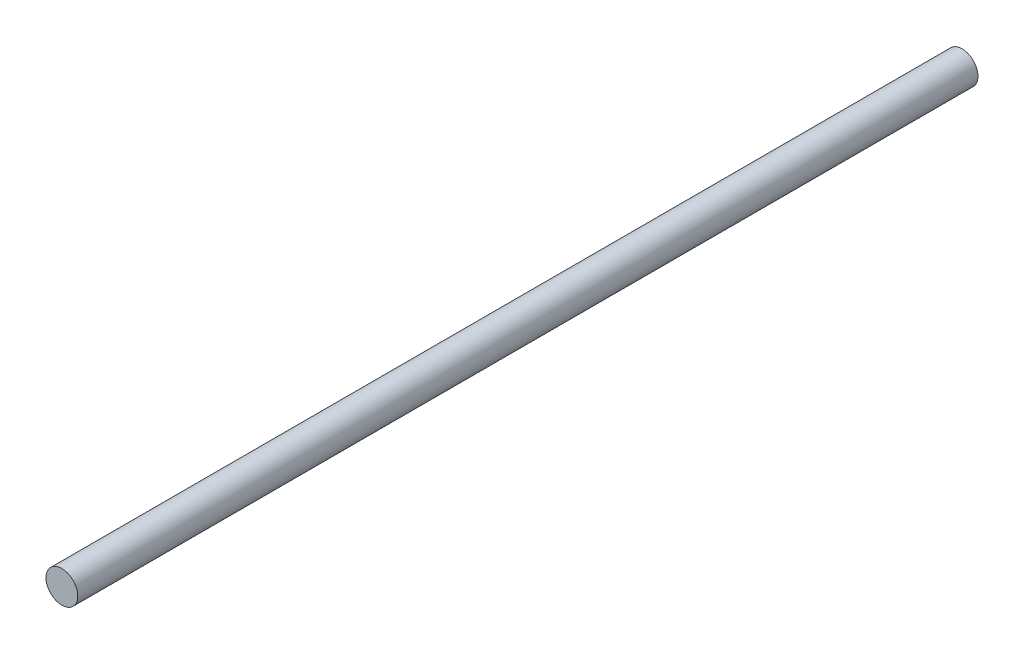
ISO-10303-21;
HEADER;
FILE_DESCRIPTION(('STEP AP214'),'2;1');
FILE_NAME('part.step','',(''),(''),'','','');
FILE_SCHEMA(('AUTOMOTIVE_DESIGN { 1 0 10303 214 1 1 1 1 }'));
ENDSEC;
DATA;
#1=APPLICATION_CONTEXT('core data for automotive mechanical design processes');
#2=APPLICATION_PROTOCOL_DEFINITION('international standard','automotive_design',2000,#1);
#3=PRODUCT_CONTEXT('',#1,'mechanical');
#4=PRODUCT('Part','Part','',(#3));
#5=PRODUCT_RELATED_PRODUCT_CATEGORY('part','',(#4));
#6=PRODUCT_DEFINITION_FORMATION('','',#4);
#7=PRODUCT_DEFINITION_CONTEXT('part definition',#1,'design');
#8=PRODUCT_DEFINITION('design','',#6,#7);
#9=PRODUCT_DEFINITION_SHAPE('','',#8);
#10=(LENGTH_UNIT() NAMED_UNIT(*) SI_UNIT(.MILLI.,.METRE.));
#11=(NAMED_UNIT(*) PLANE_ANGLE_UNIT() SI_UNIT($,.RADIAN.));
#12=(NAMED_UNIT(*) SI_UNIT($,.STERADIAN.) SOLID_ANGLE_UNIT());
#13=UNCERTAINTY_MEASURE_WITH_UNIT(LENGTH_MEASURE(1.E-05),#10,'distance_accuracy_value','');
#14=(GEOMETRIC_REPRESENTATION_CONTEXT(3) GLOBAL_UNCERTAINTY_ASSIGNED_CONTEXT((#13)) GLOBAL_UNIT_ASSIGNED_CONTEXT((#10,
#11,#12)) REPRESENTATION_CONTEXT('',''));
#15=CARTESIAN_POINT('',(0.,0.,0.));
#16=DIRECTION('',(0.,0.,1.));
#17=DIRECTION('',(1.,0.,0.));
#18=AXIS2_PLACEMENT_3D('',#15,#16,#17);
#19=CARTESIAN_POINT('',(0.,0.,-1700.));
#20=DIRECTION('',(0.,0.,1.));
#21=DIRECTION('',(1.,0.,0.));
#22=AXIS2_PLACEMENT_3D('',#19,#20,#21);
#23=CYLINDRICAL_SURFACE('',#22,30.);
#24=CARTESIAN_POINT('',(0.,0.,-1700.));
#25=DIRECTION('',(0.,0.,1.));
#26=DIRECTION('',(1.,0.,0.));
#27=AXIS2_PLACEMENT_3D('',#24,#25,#26);
#28=CIRCLE('',#27,30.);
#29=CARTESIAN_POINT('',(30.,0.,-1700.));
#30=VERTEX_POINT('',#29);
#31=EDGE_CURVE('E10',#30,#30,#28,.T.);
#32=ORIENTED_EDGE('',*,*,#31,.T.);
#33=EDGE_LOOP('',(#32));
#34=FACE_BOUND('',#33,.T.);
#35=CARTESIAN_POINT('',(0.,0.,0.));
#36=DIRECTION('',(0.,0.,1.));
#37=DIRECTION('',(1.,0.,0.));
#38=AXIS2_PLACEMENT_3D('',#35,#36,#37);
#39=CIRCLE('',#38,30.);
#40=CARTESIAN_POINT('',(30.,0.,0.));
#41=VERTEX_POINT('',#40);
#42=EDGE_CURVE('E40',#41,#41,#39,.T.);
#43=ORIENTED_EDGE('',*,*,#42,.F.);
#44=EDGE_LOOP('',(#43));
#45=FACE_BOUND('',#44,.T.);
#46=ADVANCED_FACE('F37',(#34,#45),#23,.T.);
#47=CARTESIAN_POINT('',(0.,0.,-1700.));
#48=DIRECTION('',(0.,0.,1.));
#49=DIRECTION('',(1.,0.,0.));
#50=AXIS2_PLACEMENT_3D('',#47,#48,#49);
#51=PLANE('',#50);
#52=ORIENTED_EDGE('',*,*,#31,.F.);
#53=EDGE_LOOP('',(#52));
#54=FACE_BOUND('',#53,.T.);
#55=ADVANCED_FACE('F54',(#54),#51,.F.);
#56=CARTESIAN_POINT('',(0.,0.,0.));
#57=DIRECTION('',(0.,0.,1.));
#58=DIRECTION('',(1.,0.,0.));
#59=AXIS2_PLACEMENT_3D('',#56,#57,#58);
#60=PLANE('',#59);
#61=ORIENTED_EDGE('',*,*,#42,.T.);
#62=EDGE_LOOP('',(#61));
#63=FACE_BOUND('',#62,.T.);
#64=ADVANCED_FACE('F51',(#63),#60,.T.);
#65=CLOSED_SHELL('',(#46,#55,#64));
#66=MANIFOLD_SOLID_BREP('B2',#65);
#67=ADVANCED_BREP_SHAPE_REPRESENTATION('',(#18,#66),#14);
#68=SHAPE_DEFINITION_REPRESENTATION(#9,#67);
ENDSEC;
END-ISO-10303-21;
